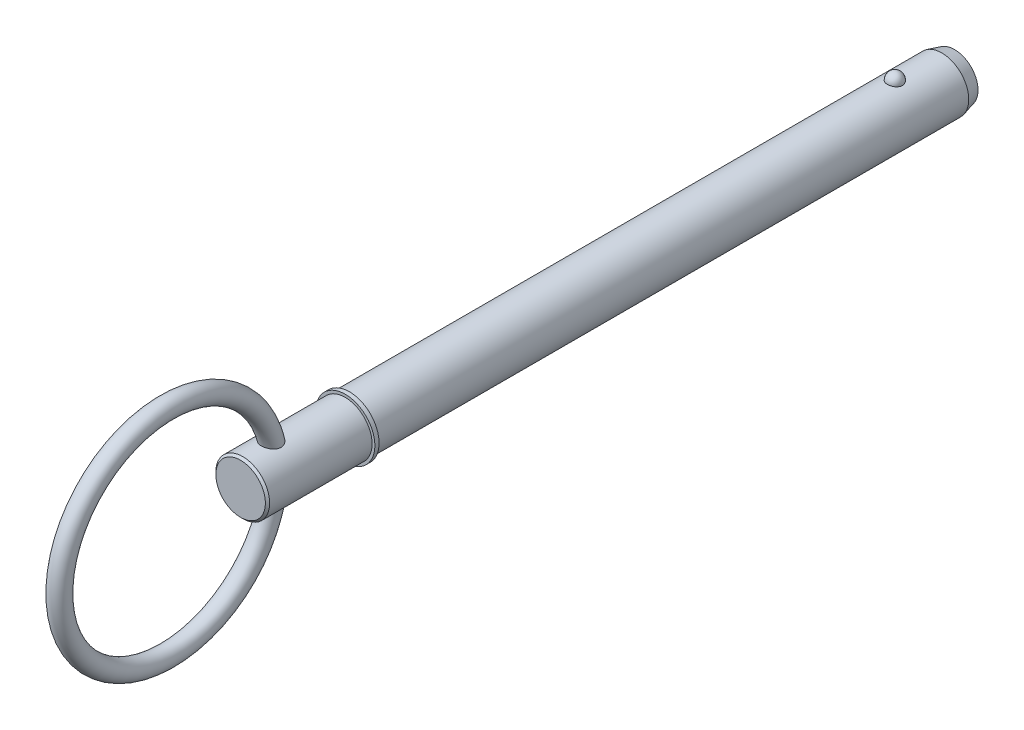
from build123d import *

# Parameters (mm, degrees)
SKETCH2_R           = 6.35
BOSS_EXTRUDE1_DEPTH = 127
BOSS_EXTRUDE2_START = 15.88
SKETCH3_R           = 6.35
BOSS_EXTRUDE2_DEPTH = 15.88
CHAMFER1_SIZE       = 3
CHAMFER1_SIZE2      = 0.803847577
SKETCH20_W          = 1
SKETCH20_H          = 7
SKETCH21_R          = 6.35
BOSS_EXTRUDE3_DEPTH = 25.7
CHAMFER2_SIZE       = 0.5
SKETCH24_R          = 2.25


with BuildPart() as part:
    # Sketch2 → Boss-Extrude1 (new body)
    with BuildSketch(Plane.XY):
        Circle(SKETCH2_R)
    extrude(amount=BOSS_EXTRUDE1_DEPTH)

    # Sketch3 → Boss-Extrude2 (add)
    with BuildSketch(Plane(origin=(0, 0, 0), x_dir=(-1, 0, 0), z_dir=(0, 0, -1)).offset(BOSS_EXTRUDE2_START)):
        Circle(SKETCH3_R)
    extrude(amount=-BOSS_EXTRUDE2_DEPTH)

    # Chamfer1
    chamfer1_edges = [part.edges().sort_by_distance(p)[0] for p in [
        (6.35, 0, -15.88),
    ]]
    chamfer1_side = [part.faces().sort_by_distance(p)[0] for p in [
        (6.35, 0, -7.94),
    ]]
    chamfer(chamfer1_edges, length=CHAMFER1_SIZE, length2=CHAMFER1_SIZE2, reference=chamfer1_side[0])

    # Sketch18 → Revolve1 (revolve)
    with BuildSketch(Plane(origin=(0, 0, 0), x_dir=(0, 0, -1), z_dir=(1, 0, 0))):
        with BuildLine():
            Line((1.78, 8.13), (1.78, 4.57))
            ThreePointArc((1.78, 4.57), (0, 6.35), (1.78, 8.13))
        make_face()
    revolve(axis=Axis((0, 8.13, -1.78), (0, -1, 0)))

    # Sketch20 → Revolve2 (revolve)
    with BuildSketch(Plane(origin=(0, 0, 0), x_dir=(0, 0, -1), z_dir=(1, 0, 0)), mode=Mode.PRIVATE) as revolve2_sk:
        with Locations((-127.5, 3.5)):
            Rectangle(SKETCH20_W, SKETCH20_H)
    revolve(revolve2_sk.sketch.rotate(Axis((0, 0, 33.728787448), (0, 0, 1)), 90), axis=Axis((0, 0, 33.728787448), (0, 0, 1)))

    # Sketch21 → Boss-Extrude3 (add)
    with BuildSketch(Plane(origin=(0, 0, 127), x_dir=(-1, 0, 0), z_dir=(0, 0, -1))):
        Circle(SKETCH21_R)
    extrude(amount=-BOSS_EXTRUDE3_DEPTH)

    # Chamfer2
    chamfer2_edges = [part.edges().sort_by_distance(p)[0] for p in [
        (6.35, 0, 152.7),
    ]]
    chamfer(chamfer2_edges, length=CHAMFER2_SIZE)

    # Sweep1: sweep along a path in Sketch23
    with BuildLine(Plane(origin=(0, 0, 0), x_dir=(0, 0, -1), z_dir=(1, 0, 0))) as sweep1_path:
        CenterArc((-170.1, 0), 25.4, 0, 360)
    # Sketch24 → Sweep1 (sweep)
    with BuildSketch(Plane(origin=(0, 0, 0), x_dir=(1, 0, 0), z_dir=(0, 1, 0))):
        with Locations((0, -144.7)):
            Circle(SKETCH24_R)
    sweep(path=sweep1_path.line)


solid = part.part
